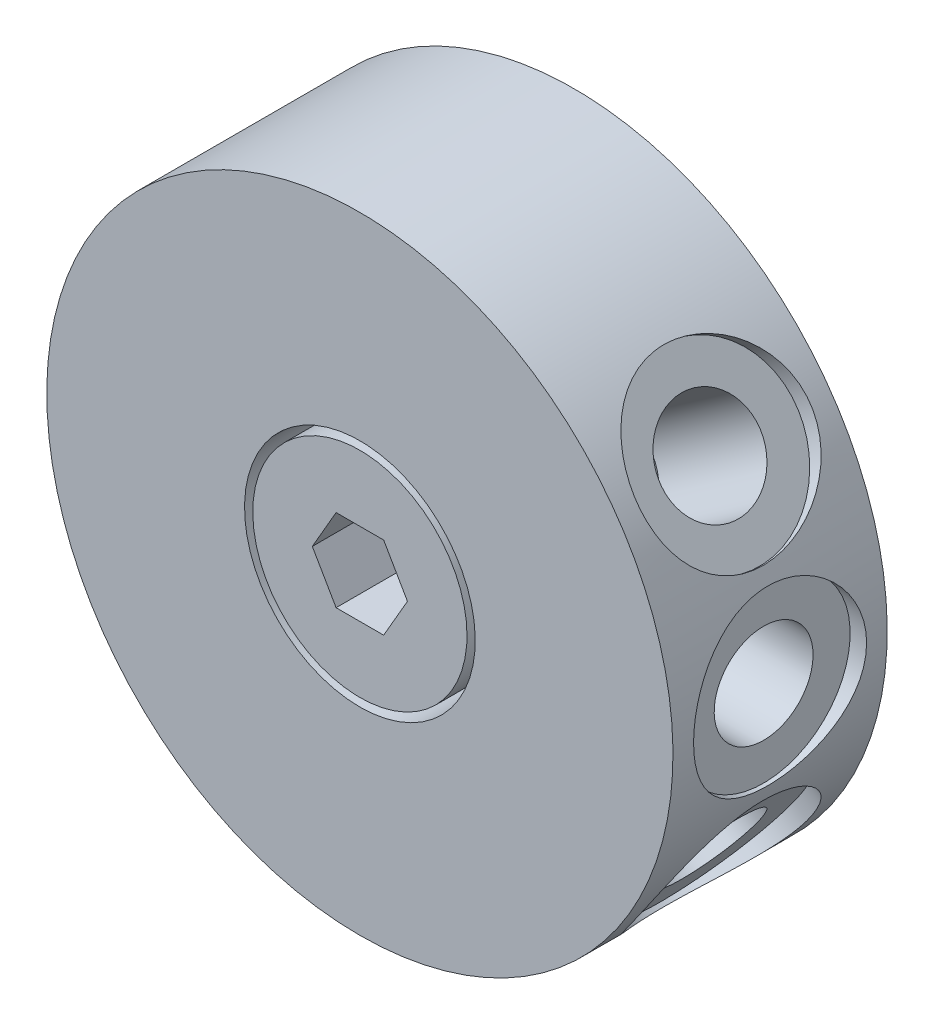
ISO-10303-21;
HEADER;
FILE_DESCRIPTION(('STEP AP214'),'2;1');
FILE_NAME('part.step','',(''),(''),'','','');
FILE_SCHEMA(('AUTOMOTIVE_DESIGN { 1 0 10303 214 1 1 1 1 }'));
ENDSEC;
DATA;
#1=APPLICATION_CONTEXT('core data for automotive mechanical design processes');
#2=APPLICATION_PROTOCOL_DEFINITION('international standard','automotive_design',2000,#1);
#3=PRODUCT_CONTEXT('',#1,'mechanical');
#4=PRODUCT('Part','Part','',(#3));
#5=PRODUCT_RELATED_PRODUCT_CATEGORY('part','',(#4));
#6=PRODUCT_DEFINITION_FORMATION('','',#4);
#7=PRODUCT_DEFINITION_CONTEXT('part definition',#1,'design');
#8=PRODUCT_DEFINITION('design','',#6,#7);
#9=PRODUCT_DEFINITION_SHAPE('','',#8);
#10=(LENGTH_UNIT() NAMED_UNIT(*) SI_UNIT(.MILLI.,.METRE.));
#11=(NAMED_UNIT(*) PLANE_ANGLE_UNIT() SI_UNIT($,.RADIAN.));
#12=(NAMED_UNIT(*) SI_UNIT($,.STERADIAN.) SOLID_ANGLE_UNIT());
#13=UNCERTAINTY_MEASURE_WITH_UNIT(LENGTH_MEASURE(1.E-05),#10,'distance_accuracy_value','');
#14=(GEOMETRIC_REPRESENTATION_CONTEXT(3) GLOBAL_UNCERTAINTY_ASSIGNED_CONTEXT((#13)) GLOBAL_UNIT_ASSIGNED_CONTEXT((#10,
#11,#12)) REPRESENTATION_CONTEXT('',''));
#15=CARTESIAN_POINT('',(0.,0.,0.));
#16=DIRECTION('',(0.,0.,1.));
#17=DIRECTION('',(1.,0.,0.));
#18=AXIS2_PLACEMENT_3D('',#15,#16,#17);
#19=CARTESIAN_POINT('',(0.,0.,13.));
#20=DIRECTION('',(0.,0.,-1.));
#21=DIRECTION('',(-0.996830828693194,0.0795506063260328,0.));
#22=AXIS2_PLACEMENT_3D('',#19,#20,#21);
#23=CYLINDRICAL_SURFACE('',#22,6.5);
#24=CARTESIAN_POINT('',(0.,0.,8.));
#25=DIRECTION('',(0.,0.,1.));
#26=DIRECTION('',(1.,0.,0.));
#27=AXIS2_PLACEMENT_3D('',#24,#25,#26);
#28=CIRCLE('',#27,6.5);
#29=CARTESIAN_POINT('',(6.5,0.,8.));
#30=VERTEX_POINT('',#29);
#31=EDGE_CURVE('E21',#30,#30,#28,.F.);
#32=ORIENTED_EDGE('',*,*,#31,.F.);
#33=EDGE_LOOP('',(#32));
#34=FACE_BOUND('',#33,.T.);
#35=CARTESIAN_POINT('',(0.,0.,13.));
#36=DIRECTION('',(0.,0.,1.));
#37=DIRECTION('',(0.996830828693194,-0.0795506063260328,0.));
#38=AXIS2_PLACEMENT_3D('',#35,#36,#37);
#39=CIRCLE('',#38,6.5);
#40=CARTESIAN_POINT('',(6.47940038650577,-0.517078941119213,13.));
#41=VERTEX_POINT('',#40);
#42=EDGE_CURVE('E125',#41,#41,#39,.T.);
#43=ORIENTED_EDGE('',*,*,#42,.F.);
#44=EDGE_LOOP('',(#43));
#45=FACE_BOUND('',#44,.T.);
#46=ADVANCED_FACE('F14',(#34,#45),#23,.T.);
#47=CARTESIAN_POINT('',(10.,0.,9.));
#48=DIRECTION('',(-1.,0.,0.));
#49=DIRECTION('',(0.,-1.,0.));
#50=AXIS2_PLACEMENT_3D('',#47,#48,#49);
#51=PLANE('',#50);
#52=CARTESIAN_POINT('',(10.,0.,6.5));
#53=DIRECTION('',(1.,0.,0.));
#54=DIRECTION('',(0.,1.,0.));
#55=AXIS2_PLACEMENT_3D('',#52,#53,#54);
#56=CIRCLE('',#55,3.);
#57=CARTESIAN_POINT('',(10.,2.99999999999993,6.5));
#58=VERTEX_POINT('',#57);
#59=EDGE_CURVE('E146',#58,#58,#56,.T.);
#60=ORIENTED_EDGE('',*,*,#59,.T.);
#61=EDGE_LOOP('',(#60));
#62=FACE_BOUND('',#61,.T.);
#63=ADVANCED_FACE('F207',(#62),#51,.F.);
#64=CARTESIAN_POINT('',(8.19152044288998,-5.73576436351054,9.));
#65=DIRECTION('',(-0.819152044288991,0.573576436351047,0.));
#66=DIRECTION('',(-0.573576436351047,-0.819152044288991,0.));
#67=AXIS2_PLACEMENT_3D('',#64,#65,#66);
#68=PLANE('',#67);
#69=CARTESIAN_POINT('',(8.19152044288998,-5.73576436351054,6.5));
#70=DIRECTION('',(0.819152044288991,-0.573576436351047,0.));
#71=DIRECTION('',(0.573576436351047,0.819152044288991,0.));
#72=AXIS2_PLACEMENT_3D('',#69,#70,#71);
#73=CIRCLE('',#72,3.);
#74=CARTESIAN_POINT('',(9.91224975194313,-3.27830823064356,6.5));
#75=VERTEX_POINT('',#74);
#76=EDGE_CURVE('E137',#75,#75,#73,.T.);
#77=ORIENTED_EDGE('',*,*,#76,.T.);
#78=EDGE_LOOP('',(#77));
#79=FACE_BOUND('',#78,.T.);
#80=ADVANCED_FACE('F213',(#79),#68,.F.);
#81=CARTESIAN_POINT('',(8.19152044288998,5.7357643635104,9.));
#82=DIRECTION('',(-0.819152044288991,-0.573576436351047,0.));
#83=DIRECTION('',(0.573576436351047,-0.819152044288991,0.));
#84=AXIS2_PLACEMENT_3D('',#81,#82,#83);
#85=PLANE('',#84);
#86=CARTESIAN_POINT('',(8.19152044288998,5.7357643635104,6.5));
#87=DIRECTION('',(0.819152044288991,0.573576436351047,0.));
#88=DIRECTION('',(-0.573576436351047,0.819152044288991,0.));
#89=AXIS2_PLACEMENT_3D('',#86,#87,#88);
#90=CIRCLE('',#89,3.);
#91=CARTESIAN_POINT('',(6.47079113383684,8.19322049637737,6.5));
#92=VERTEX_POINT('',#91);
#93=EDGE_CURVE('E128',#92,#92,#90,.T.);
#94=ORIENTED_EDGE('',*,*,#93,.T.);
#95=EDGE_LOOP('',(#94));
#96=FACE_BOUND('',#95,.T.);
#97=ADVANCED_FACE('F240',(#96),#85,.F.);
#98=CARTESIAN_POINT('',(18.,0.,6.5));
#99=DIRECTION('',(1.,0.,0.));
#100=DIRECTION('',(0.,1.,0.));
#101=AXIS2_PLACEMENT_3D('',#98,#99,#100);
#102=CYLINDRICAL_SURFACE('',#101,3.);
#103=ORIENTED_EDGE('',*,*,#59,.F.);
#104=EDGE_LOOP('',(#103));
#105=FACE_BOUND('',#104,.T.);
#106=CARTESIAN_POINT('',(18.,0.,6.5));
#107=DIRECTION('',(1.,0.,0.));
#108=DIRECTION('',(0.,1.,0.));
#109=AXIS2_PLACEMENT_3D('',#106,#107,#108);
#110=CIRCLE('',#109,3.);
#111=CARTESIAN_POINT('',(18.,2.99999999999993,6.5));
#112=VERTEX_POINT('',#111);
#113=EDGE_CURVE('E149',#112,#112,#110,.T.);
#114=ORIENTED_EDGE('',*,*,#113,.T.);
#115=EDGE_LOOP('',(#114));
#116=FACE_BOUND('',#115,.T.);
#117=ADVANCED_FACE('F246',(#105,#116),#102,.F.);
#118=CARTESIAN_POINT('',(14.7447367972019,-10.3243758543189,6.5));
#119=DIRECTION('',(0.819152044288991,-0.573576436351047,0.));
#120=DIRECTION('',(0.573576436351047,0.819152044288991,0.));
#121=AXIS2_PLACEMENT_3D('',#118,#119,#120);
#122=CYLINDRICAL_SURFACE('',#121,3.);
#123=CARTESIAN_POINT('',(14.7447367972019,-10.3243758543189,6.5));
#124=DIRECTION('',(0.819152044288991,-0.573576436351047,0.));
#125=DIRECTION('',(0.573576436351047,0.819152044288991,0.));
#126=AXIS2_PLACEMENT_3D('',#123,#124,#125);
#127=CIRCLE('',#126,3.);
#128=CARTESIAN_POINT('',(16.465466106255,-7.86691972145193,6.5));
#129=VERTEX_POINT('',#128);
#130=EDGE_CURVE('E140',#129,#129,#127,.T.);
#131=CARTESIAN_POINT('',(9.91224975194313,-3.27830823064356,6.5));
#132=CARTESIAN_POINT('',(9.98051242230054,-3.32610626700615,6.5));
#133=CARTESIAN_POINT('',(10.048775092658,-3.37390430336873,6.5));
#134=CARTESIAN_POINT('',(10.1853004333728,-3.46950037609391,6.5));
#135=CARTESIAN_POINT('',(10.2535631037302,-3.5172984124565,6.5));
#136=CARTESIAN_POINT('',(10.390088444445,-3.61289448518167,6.5));
#137=CARTESIAN_POINT('',(10.4583511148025,-3.66069252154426,6.5));
#138=CARTESIAN_POINT('',(10.5948764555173,-3.75628859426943,6.5));
#139=CARTESIAN_POINT('',(10.6631391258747,-3.80408663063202,6.5));
#140=CARTESIAN_POINT('',(10.7996644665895,-3.89968270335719,6.5));
#141=CARTESIAN_POINT('',(10.8679271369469,-3.94748073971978,6.5));
#142=CARTESIAN_POINT('',(11.0044524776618,-4.04307681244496,6.5));
#143=CARTESIAN_POINT('',(11.0727151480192,-4.09087484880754,6.5));
#144=CARTESIAN_POINT('',(11.209240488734,-4.18647092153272,6.5));
#145=CARTESIAN_POINT('',(11.2775031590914,-4.2342689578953,6.5));
#146=CARTESIAN_POINT('',(11.4140284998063,-4.32986503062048,6.5));
#147=CARTESIAN_POINT('',(11.4822911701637,-4.37766306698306,6.5));
#148=CARTESIAN_POINT('',(11.6188165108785,-4.47325913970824,6.5));
#149=CARTESIAN_POINT('',(11.6870791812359,-4.52105717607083,6.5));
#150=CARTESIAN_POINT('',(11.8236045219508,-4.616653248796,6.5));
#151=CARTESIAN_POINT('',(11.8918671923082,-4.66445128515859,6.5));
#152=CARTESIAN_POINT('',(12.028392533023,-4.76004735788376,6.5));
#153=CARTESIAN_POINT('',(12.0966552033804,-4.80784539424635,6.5));
#154=CARTESIAN_POINT('',(12.2331805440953,-4.90344146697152,6.5));
#155=CARTESIAN_POINT('',(12.3014432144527,-4.95123950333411,6.5));
#156=CARTESIAN_POINT('',(12.4379685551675,-5.04683557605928,6.5));
#157=CARTESIAN_POINT('',(12.5062312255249,-5.09463361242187,6.5));
#158=CARTESIAN_POINT('',(12.6427565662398,-5.19022968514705,6.5));
#159=CARTESIAN_POINT('',(12.7110192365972,-5.23802772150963,6.5));
#160=CARTESIAN_POINT('',(12.847544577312,-5.33362379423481,6.5));
#161=CARTESIAN_POINT('',(12.9158072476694,-5.38142183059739,6.5));
#162=CARTESIAN_POINT('',(13.0523325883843,-5.47701790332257,6.5));
#163=CARTESIAN_POINT('',(13.1205952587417,-5.52481593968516,6.5));
#164=CARTESIAN_POINT('',(13.2571205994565,-5.62041201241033,6.5));
#165=CARTESIAN_POINT('',(13.3253832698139,-5.66821004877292,6.5));
#166=CARTESIAN_POINT('',(13.4619086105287,-5.76380612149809,6.5));
#167=CARTESIAN_POINT('',(13.5301712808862,-5.81160415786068,6.5));
#168=CARTESIAN_POINT('',(13.666696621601,-5.90720023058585,6.5));
#169=CARTESIAN_POINT('',(13.7349592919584,-5.95499826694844,6.5));
#170=CARTESIAN_POINT('',(13.8714846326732,-6.05059433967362,6.5));
#171=CARTESIAN_POINT('',(13.9397473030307,-6.0983923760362,6.5));
#172=CARTESIAN_POINT('',(14.0762726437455,-6.19398844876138,6.5));
#173=CARTESIAN_POINT('',(14.1445353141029,-6.24178648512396,6.5));
#174=CARTESIAN_POINT('',(14.2810606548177,-6.33738255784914,6.5));
#175=CARTESIAN_POINT('',(14.3493233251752,-6.38518059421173,6.5));
#176=CARTESIAN_POINT('',(14.48584866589,-6.4807766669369,6.5));
#177=CARTESIAN_POINT('',(14.5541113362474,-6.52857470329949,6.5));
#178=CARTESIAN_POINT('',(14.6906366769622,-6.62417077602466,6.5));
#179=CARTESIAN_POINT('',(14.7588993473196,-6.67196881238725,6.5));
#180=CARTESIAN_POINT('',(14.8954246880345,-6.76756488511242,6.5));
#181=CARTESIAN_POINT('',(14.9636873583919,-6.81536292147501,6.5));
#182=CARTESIAN_POINT('',(15.1002126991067,-6.91095899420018,6.5));
#183=CARTESIAN_POINT('',(15.1684753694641,-6.95875703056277,6.5));
#184=CARTESIAN_POINT('',(15.305000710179,-7.05435310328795,6.5));
#185=CARTESIAN_POINT('',(15.3732633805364,-7.10215113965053,6.5));
#186=CARTESIAN_POINT('',(15.5097887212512,-7.19774721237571,6.5));
#187=CARTESIAN_POINT('',(15.5780513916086,-7.24554524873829,6.5));
#188=CARTESIAN_POINT('',(15.7145767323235,-7.34114132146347,6.5));
#189=CARTESIAN_POINT('',(15.7828394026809,-7.38893935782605,6.5));
#190=CARTESIAN_POINT('',(15.9193647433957,-7.48453543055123,6.5));
#191=CARTESIAN_POINT('',(15.9876274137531,-7.53233346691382,6.5));
#192=CARTESIAN_POINT('',(16.124152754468,-7.62792953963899,6.5));
#193=CARTESIAN_POINT('',(16.1924154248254,-7.67572757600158,6.5));
#194=CARTESIAN_POINT('',(16.3289407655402,-7.77132364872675,6.5));
#195=CARTESIAN_POINT('',(16.3972034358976,-7.81912168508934,6.5));
#196=CARTESIAN_POINT('',(16.465466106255,-7.86691972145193,6.5));
#197=B_SPLINE_CURVE_WITH_KNOTS('',3,(#131,#132,#133,#134,#135,#136,#137,#138,#139,#140,#141,
#142,#143,#144,#145,#146,#147,#148,#149,#150,#151,#152,#153,#154,#155,#156,#157,#158,#159,#160,
#161,#162,#163,#164,#165,#166,#167,#168,#169,#170,#171,#172,#173,#174,#175,#176,#177,#178,#179,
#180,#181,#182,#183,#184,#185,#186,#187,#188,#189,#190,#191,#192,#193,#194,#195,#196),
.UNSPECIFIED.,.F.,.F.,(4,2,2,2,2,2,2,2,2,2,2,2,2,2,2,2,2,2,2,2,2,2,2,2,2,2,2,2,2,2,2,2,4),(0.,
0.249999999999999,0.499999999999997,0.749999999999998,0.999999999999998,1.25,1.5,1.75,
1.99999999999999,2.25,2.49999999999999,2.74999999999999,2.99999999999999,3.24999999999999,
3.49999999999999,3.74999999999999,3.99999999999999,4.24999999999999,4.49999999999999,
4.74999999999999,4.99999999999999,5.24999999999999,5.49999999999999,5.74999999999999,
5.99999999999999,6.24999999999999,6.49999999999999,6.74999999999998,6.99999999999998,
7.24999999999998,7.49999999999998,7.74999999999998,7.99999999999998),.UNSPECIFIED.);
#198=EDGE_CURVE('BSEAM242',#75,#129,#197,.T.);
#199=ORIENTED_EDGE('',*,*,#76,.F.);
#200=ORIENTED_EDGE('',*,*,#130,.T.);
#201=ORIENTED_EDGE('',*,*,#198,.T.);
#202=ORIENTED_EDGE('',*,*,#198,.F.);
#203=EDGE_LOOP('',(#199,#201,#200,#202));
#204=FACE_BOUND('',#203,.T.);
#205=ADVANCED_FACE('F242',(#204),#122,.F.);
#206=CARTESIAN_POINT('',(14.7447367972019,10.3243758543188,6.5));
#207=DIRECTION('',(0.819152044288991,0.573576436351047,0.));
#208=DIRECTION('',(-0.573576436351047,0.819152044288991,0.));
#209=AXIS2_PLACEMENT_3D('',#206,#207,#208);
#210=CYLINDRICAL_SURFACE('',#209,3.);
#211=CARTESIAN_POINT('',(14.7447367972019,10.3243758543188,6.5));
#212=DIRECTION('',(0.819152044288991,0.573576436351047,0.));
#213=DIRECTION('',(-0.573576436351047,0.819152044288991,0.));
#214=AXIS2_PLACEMENT_3D('',#211,#212,#213);
#215=CIRCLE('',#214,3.);
#216=CARTESIAN_POINT('',(13.0240074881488,12.7818319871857,6.5));
#217=VERTEX_POINT('',#216);
#218=EDGE_CURVE('E131',#217,#217,#215,.T.);
#219=CARTESIAN_POINT('',(6.47079113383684,8.19322049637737,6.5));
#220=CARTESIAN_POINT('',(6.53905380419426,8.24101853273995,6.5));
#221=CARTESIAN_POINT('',(6.60731647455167,8.28881656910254,6.5));
#222=CARTESIAN_POINT('',(6.74384181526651,8.38441264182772,6.5));
#223=CARTESIAN_POINT('',(6.81210448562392,8.4322106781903,6.5));
#224=CARTESIAN_POINT('',(6.94862982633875,8.52780675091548,6.5));
#225=CARTESIAN_POINT('',(7.01689249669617,8.57560478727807,6.5));
#226=CARTESIAN_POINT('',(7.153417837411,8.67120086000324,6.5));
#227=CARTESIAN_POINT('',(7.22168050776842,8.71899889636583,6.5));
#228=CARTESIAN_POINT('',(7.35820584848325,8.814594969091,6.5));
#229=CARTESIAN_POINT('',(7.42646851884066,8.86239300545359,6.5));
#230=CARTESIAN_POINT('',(7.5629938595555,8.95798907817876,6.5));
#231=CARTESIAN_POINT('',(7.63125652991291,9.00578711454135,6.5));
#232=CARTESIAN_POINT('',(7.76778187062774,9.10138318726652,6.5));
#233=CARTESIAN_POINT('',(7.83604454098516,9.14918122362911,6.5));
#234=CARTESIAN_POINT('',(7.97256988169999,9.24477729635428,6.5));
#235=CARTESIAN_POINT('',(8.04083255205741,9.29257533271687,6.5));
#236=CARTESIAN_POINT('',(8.17735789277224,9.38817140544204,6.5));
#237=CARTESIAN_POINT('',(8.24562056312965,9.43596944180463,6.5));
#238=CARTESIAN_POINT('',(8.38214590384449,9.5315655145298,6.5));
#239=CARTESIAN_POINT('',(8.4504085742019,9.57936355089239,6.5));
#240=CARTESIAN_POINT('',(8.58693391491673,9.67495962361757,6.5));
#241=CARTESIAN_POINT('',(8.65519658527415,9.72275765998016,6.5));
#242=CARTESIAN_POINT('',(8.79172192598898,9.81835373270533,6.5));
#243=CARTESIAN_POINT('',(8.8599845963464,9.86615176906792,6.5));
#244=CARTESIAN_POINT('',(8.99650993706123,9.96174784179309,6.5));
#245=CARTESIAN_POINT('',(9.06477260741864,10.0095458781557,6.5));
#246=CARTESIAN_POINT('',(9.20129794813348,10.1051419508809,6.5));
#247=CARTESIAN_POINT('',(9.26956061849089,10.1529399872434,6.5));
#248=CARTESIAN_POINT('',(9.40608595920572,10.2485360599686,6.5));
#249=CARTESIAN_POINT('',(9.47434862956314,10.2963340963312,6.5));
#250=CARTESIAN_POINT('',(9.61087397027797,10.3919301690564,6.5));
#251=CARTESIAN_POINT('',(9.67913664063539,10.439728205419,6.5));
#252=CARTESIAN_POINT('',(9.81566198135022,10.5353242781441,6.5));
#253=CARTESIAN_POINT('',(9.88392465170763,10.5831223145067,6.5));
#254=CARTESIAN_POINT('',(10.0204499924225,10.6787183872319,6.5));
#255=CARTESIAN_POINT('',(10.0887126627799,10.7265164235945,6.5));
#256=CARTESIAN_POINT('',(10.2252380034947,10.8221124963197,6.5));
#257=CARTESIAN_POINT('',(10.2935006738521,10.8699105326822,6.5));
#258=CARTESIAN_POINT('',(10.430026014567,10.9655066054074,6.5));
#259=CARTESIAN_POINT('',(10.4982886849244,11.01330464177,6.5));
#260=CARTESIAN_POINT('',(10.6348140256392,11.1089007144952,6.5));
#261=CARTESIAN_POINT('',(10.7030766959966,11.1566987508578,6.5));
#262=CARTESIAN_POINT('',(10.8396020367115,11.2522948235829,6.5));
#263=CARTESIAN_POINT('',(10.9078647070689,11.3000928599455,6.5));
#264=CARTESIAN_POINT('',(11.0443900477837,11.3956889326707,6.5));
#265=CARTESIAN_POINT('',(11.1126527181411,11.4434869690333,6.5));
#266=CARTESIAN_POINT('',(11.249178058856,11.5390830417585,6.5));
#267=CARTESIAN_POINT('',(11.3174407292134,11.5868810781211,6.5));
#268=CARTESIAN_POINT('',(11.4539660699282,11.6824771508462,6.5));
#269=CARTESIAN_POINT('',(11.5222287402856,11.7302751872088,6.5));
#270=CARTESIAN_POINT('',(11.6587540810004,11.825871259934,6.5));
#271=CARTESIAN_POINT('',(11.7270167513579,11.8736692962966,6.5));
#272=CARTESIAN_POINT('',(11.8635420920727,11.9692653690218,6.5));
#273=CARTESIAN_POINT('',(11.9318047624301,12.0170634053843,6.5));
#274=CARTESIAN_POINT('',(12.0683301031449,12.1126594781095,6.5));
#275=CARTESIAN_POINT('',(12.1365927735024,12.1604575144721,6.5));
#276=CARTESIAN_POINT('',(12.2731181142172,12.2560535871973,6.5));
#277=CARTESIAN_POINT('',(12.3413807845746,12.3038516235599,6.5));
#278=CARTESIAN_POINT('',(12.4779061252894,12.399447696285,6.5));
#279=CARTESIAN_POINT('',(12.5461687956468,12.4472457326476,6.5));
#280=CARTESIAN_POINT('',(12.6826941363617,12.5428418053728,6.5));
#281=CARTESIAN_POINT('',(12.7509568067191,12.5906398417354,6.5));
#282=CARTESIAN_POINT('',(12.8874821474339,12.6862359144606,6.5));
#283=CARTESIAN_POINT('',(12.9557448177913,12.7340339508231,6.5));
#284=CARTESIAN_POINT('',(13.0240074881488,12.7818319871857,6.5));
#285=B_SPLINE_CURVE_WITH_KNOTS('',3,(#219,#220,#221,#222,#223,#224,#225,#226,#227,#228,#229,
#230,#231,#232,#233,#234,#235,#236,#237,#238,#239,#240,#241,#242,#243,#244,#245,#246,#247,#248,
#249,#250,#251,#252,#253,#254,#255,#256,#257,#258,#259,#260,#261,#262,#263,#264,#265,#266,#267,
#268,#269,#270,#271,#272,#273,#274,#275,#276,#277,#278,#279,#280,#281,#282,#283,#284),
.UNSPECIFIED.,.F.,.F.,(4,2,2,2,2,2,2,2,2,2,2,2,2,2,2,2,2,2,2,2,2,2,2,2,2,2,2,2,2,2,2,2,4),(0.,
0.249999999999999,0.5,0.75,0.999999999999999,1.25,1.5,1.75,2.,2.25,2.5,2.74999999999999,
2.99999999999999,3.25,3.49999999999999,3.74999999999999,3.99999999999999,4.24999999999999,
4.49999999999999,4.74999999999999,4.99999999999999,5.24999999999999,5.49999999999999,
5.74999999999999,5.99999999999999,6.24999999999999,6.49999999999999,6.74999999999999,
6.99999999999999,7.24999999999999,7.49999999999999,7.74999999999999,7.99999999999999),.UNSPECIFIED.);
#286=EDGE_CURVE('BSEAM245',#92,#217,#285,.T.);
#287=ORIENTED_EDGE('',*,*,#93,.F.);
#288=ORIENTED_EDGE('',*,*,#218,.T.);
#289=ORIENTED_EDGE('',*,*,#286,.T.);
#290=ORIENTED_EDGE('',*,*,#286,.F.);
#291=EDGE_LOOP('',(#287,#289,#288,#290));
#292=FACE_BOUND('',#291,.T.);
#293=ADVANCED_FACE('F245',(#292),#210,.F.);
#294=CARTESIAN_POINT('',(18.,0.,6.5));
#295=DIRECTION('',(1.,0.,0.));
#296=DIRECTION('',(0.,0.,1.));
#297=AXIS2_PLACEMENT_3D('',#294,#295,#296);
#298=PLANE('',#297);
#299=ORIENTED_EDGE('',*,*,#113,.F.);
#300=EDGE_LOOP('',(#299));
#301=FACE_BOUND('',#300,.T.);
#302=CARTESIAN_POINT('',(18.,0.,6.5));
#303=DIRECTION('',(1.,0.,0.));
#304=DIRECTION('',(0.,0.,1.));
#305=AXIS2_PLACEMENT_3D('',#302,#303,#304);
#306=CIRCLE('',#305,5.25);
#307=CARTESIAN_POINT('',(18.,0.,11.75));
#308=VERTEX_POINT('',#307);
#309=EDGE_CURVE('E152',#308,#308,#306,.T.);
#310=ORIENTED_EDGE('',*,*,#309,.T.);
#311=EDGE_LOOP('',(#310));
#312=FACE_BOUND('',#311,.T.);
#313=ADVANCED_FACE('F187',(#301,#312),#298,.T.);
#314=CARTESIAN_POINT('',(14.7447367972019,-10.3243758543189,6.5));
#315=DIRECTION('',(0.819152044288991,-0.573576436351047,0.));
#316=DIRECTION('',(0.,0.,1.));
#317=AXIS2_PLACEMENT_3D('',#314,#315,#316);
#318=PLANE('',#317);
#319=ORIENTED_EDGE('',*,*,#130,.F.);
#320=EDGE_LOOP('',(#319));
#321=FACE_BOUND('',#320,.T.);
#322=CARTESIAN_POINT('',(14.7447367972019,-10.3243758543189,6.5));
#323=DIRECTION('',(0.819152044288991,-0.573576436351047,0.));
#324=DIRECTION('',(0.,0.,1.));
#325=AXIS2_PLACEMENT_3D('',#322,#323,#324);
#326=CIRCLE('',#325,5.25);
#327=CARTESIAN_POINT('',(14.7447367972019,-10.3243758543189,11.75));
#328=VERTEX_POINT('',#327);
#329=EDGE_CURVE('E143',#328,#328,#326,.T.);
#330=ORIENTED_EDGE('',*,*,#329,.T.);
#331=EDGE_LOOP('',(#330));
#332=FACE_BOUND('',#331,.T.);
#333=ADVANCED_FACE('F248',(#321,#332),#318,.T.);
#334=CARTESIAN_POINT('',(14.7447367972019,10.3243758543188,6.5));
#335=DIRECTION('',(0.819152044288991,0.573576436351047,0.));
#336=DIRECTION('',(0.,0.,1.));
#337=AXIS2_PLACEMENT_3D('',#334,#335,#336);
#338=PLANE('',#337);
#339=ORIENTED_EDGE('',*,*,#218,.F.);
#340=EDGE_LOOP('',(#339));
#341=FACE_BOUND('',#340,.T.);
#342=CARTESIAN_POINT('',(14.7447367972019,10.3243758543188,6.5));
#343=DIRECTION('',(0.819152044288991,0.573576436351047,0.));
#344=DIRECTION('',(0.,0.,1.));
#345=AXIS2_PLACEMENT_3D('',#342,#343,#344);
#346=CIRCLE('',#345,5.25);
#347=CARTESIAN_POINT('',(14.7447367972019,10.3243758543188,11.75));
#348=VERTEX_POINT('',#347);
#349=EDGE_CURVE('E134',#348,#348,#346,.T.);
#350=ORIENTED_EDGE('',*,*,#349,.T.);
#351=EDGE_LOOP('',(#350));
#352=FACE_BOUND('',#351,.T.);
#353=ADVANCED_FACE('F185',(#341,#352),#338,.T.);
#354=CARTESIAN_POINT('',(18.,0.,6.5));
#355=DIRECTION('',(1.,0.,0.));
#356=DIRECTION('',(0.,0.,1.));
#357=AXIS2_PLACEMENT_3D('',#354,#355,#356);
#358=CYLINDRICAL_SURFACE('',#357,5.25);
#359=ORIENTED_EDGE('',*,*,#309,.F.);
#360=EDGE_LOOP('',(#359));
#361=FACE_BOUND('',#360,.T.);
#362=CARTESIAN_POINT('',(19.,0.,11.75));
#363=CARTESIAN_POINT('',(18.9999960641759,0.289025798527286,11.749993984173));
#364=CARTESIAN_POINT('',(18.9933406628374,0.578114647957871,11.7260527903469));
#365=CARTESIAN_POINT('',(18.9674382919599,1.14793901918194,11.6311060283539));
#366=CARTESIAN_POINT('',(18.9481859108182,1.4286708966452,11.5600802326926));
#367=CARTESIAN_POINT('',(18.8992102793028,1.9734757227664,11.3734689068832));
#368=CARTESIAN_POINT('',(18.8695010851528,2.23757047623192,11.2579431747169));
#369=CARTESIAN_POINT('',(18.802736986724,2.74263822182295,10.9858396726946));
#370=CARTESIAN_POINT('',(18.7656814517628,2.98360922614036,10.8292583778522));
#371=CARTESIAN_POINT('',(18.687186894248,3.44155081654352,10.4754004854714));
#372=CARTESIAN_POINT('',(18.6456686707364,3.65786793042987,10.2772957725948));
#373=CARTESIAN_POINT('',(18.5634263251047,4.05467053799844,9.8477832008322));
#374=CARTESIAN_POINT('',(18.5227023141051,4.23515104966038,9.61637071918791));
#375=CARTESIAN_POINT('',(18.4458416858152,4.55841291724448,9.12150880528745));
#376=CARTESIAN_POINT('',(18.4098045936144,4.70042982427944,8.8575431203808));
#377=CARTESIAN_POINT('',(18.3475680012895,4.9378044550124,8.30832293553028));
#378=CARTESIAN_POINT('',(18.3213665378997,5.03317149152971,8.02307269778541));
#379=CARTESIAN_POINT('',(18.2825876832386,5.17224549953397,7.44664725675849));
#380=CARTESIAN_POINT('',(18.2696969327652,5.21714299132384,7.15578089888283));
#381=CARTESIAN_POINT('',(18.2580638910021,5.25771687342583,6.57038081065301));
#382=CARTESIAN_POINT('',(18.2593187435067,5.25340320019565,6.27584783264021));
#383=CARTESIAN_POINT('',(18.2755554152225,5.19661953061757,5.7008727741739));
#384=CARTESIAN_POINT('',(18.2901226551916,5.1456038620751,5.42027347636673));
#385=CARTESIAN_POINT('',(18.3306770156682,4.99919931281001,4.87178107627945));
#386=CARTESIAN_POINT('',(18.3566651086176,4.90380665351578,4.60388905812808));
#387=CARTESIAN_POINT('',(18.4174879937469,4.67020315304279,4.08469028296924));
#388=CARTESIAN_POINT('',(18.4524250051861,4.53149321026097,3.83362056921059));
#389=CARTESIAN_POINT('',(18.5271558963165,4.21554036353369,3.35781646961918));
#390=CARTESIAN_POINT('',(18.5669507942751,4.0382893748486,3.13308762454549));
#391=CARTESIAN_POINT('',(18.6486270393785,3.64290902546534,2.70805141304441));
#392=CARTESIAN_POINT('',(18.6905325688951,3.42356223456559,2.50887948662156));
#393=CARTESIAN_POINT('',(18.7704587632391,2.95406494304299,2.14990527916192));
#394=CARTESIAN_POINT('',(18.8084792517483,2.70391304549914,1.99010478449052));
#395=CARTESIAN_POINT('',(18.8766146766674,2.17806364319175,1.71385813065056));
#396=CARTESIAN_POINT('',(18.9066895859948,1.90224592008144,1.59763029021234));
#397=CARTESIAN_POINT('',(18.9552564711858,1.33396186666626,1.41352797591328));
#398=CARTESIAN_POINT('',(18.9737511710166,1.04149946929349,1.3456421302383));
#399=CARTESIAN_POINT('',(18.9966565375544,0.45790750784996,1.2619633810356));
#400=CARTESIAN_POINT('',(19.0014840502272,0.1670151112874,1.24462818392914));
#401=CARTESIAN_POINT('',(18.9977163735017,-0.413525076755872,1.25826588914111));
#402=CARTESIAN_POINT('',(18.9891226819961,-0.703173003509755,1.28923340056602));
#403=CARTESIAN_POINT('',(18.9597485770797,-1.26740948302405,1.39733687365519));
#404=CARTESIAN_POINT('',(18.9391983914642,-1.54217813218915,1.47360118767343));
#405=CARTESIAN_POINT('',(18.8882535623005,-2.07498632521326,1.66911108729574));
#406=CARTESIAN_POINT('',(18.8578578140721,-2.33302398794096,1.78836149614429));
#407=CARTESIAN_POINT('',(18.7896307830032,-2.83095037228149,2.06924258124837));
#408=CARTESIAN_POINT('',(18.7516589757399,-3.07035455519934,2.23169720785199));
#409=CARTESIAN_POINT('',(18.6726628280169,-3.51904128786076,2.59334943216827));
#410=CARTESIAN_POINT('',(18.6316378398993,-3.72831741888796,2.79255483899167));
#411=CARTESIAN_POINT('',(18.5496062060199,-4.11739039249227,3.22926885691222));
#412=CARTESIAN_POINT('',(18.5086381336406,-4.29609594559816,3.4677588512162));
#413=CARTESIAN_POINT('',(18.4327188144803,-4.61098813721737,3.97221838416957));
#414=CARTESIAN_POINT('',(18.3977673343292,-4.74717642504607,4.23818685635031));
#415=CARTESIAN_POINT('',(18.3382454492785,-4.97215298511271,4.78882447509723));
#416=CARTESIAN_POINT('',(18.3136171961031,-5.06120614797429,5.0733787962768));
#417=CARTESIAN_POINT('',(18.2775534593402,-5.18995134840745,5.65422818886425));
#418=CARTESIAN_POINT('',(18.2661142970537,-5.22965715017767,5.95051996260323));
#419=CARTESIAN_POINT('',(18.258047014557,-5.2577468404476,6.53521733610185));
#420=CARTESIAN_POINT('',(18.2609108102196,-5.24789121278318,6.82353256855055));
#421=CARTESIAN_POINT('',(18.2799282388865,-5.18125456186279,7.39421880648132));
#422=CARTESIAN_POINT('',(18.2960814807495,-5.12447491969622,7.67658998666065));
#423=CARTESIAN_POINT('',(18.3395441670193,-4.9666566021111,8.22497348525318));
#424=CARTESIAN_POINT('',(18.3667529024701,-4.86601688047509,8.49110916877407));
#425=CARTESIAN_POINT('',(18.4292569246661,-4.62364385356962,9.00292456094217));
#426=CARTESIAN_POINT('',(18.4645535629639,-4.4819036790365,9.24860084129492));
#427=CARTESIAN_POINT('',(18.5406411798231,-4.1561275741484,9.72086267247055));
#428=CARTESIAN_POINT('',(18.5815699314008,-3.97090277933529,9.94660600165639));
#429=CARTESIAN_POINT('',(18.6635705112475,-3.56564240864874,10.3643779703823));
#430=CARTESIAN_POINT('',(18.7046423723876,-3.3455982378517,10.5563982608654));
#431=CARTESIAN_POINT('',(18.7834557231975,-2.87071326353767,10.9057242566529));
#432=CARTESIAN_POINT('',(18.8210963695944,-2.61517673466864,11.0621089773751));
#433=CARTESIAN_POINT('',(18.8876761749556,-2.0804034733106,11.3294578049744));
#434=CARTESIAN_POINT('',(18.916620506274,-1.80118095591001,11.4404489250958));
#435=CARTESIAN_POINT('',(18.9591357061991,-1.26946355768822,11.6006205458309));
#436=CARTESIAN_POINT('',(18.9743441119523,-1.01909851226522,11.6565019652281));
#437=CARTESIAN_POINT('',(18.9947774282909,-0.512505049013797,11.7311922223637));
#438=CARTESIAN_POINT('',(19.0000034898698,-0.256277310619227,11.750005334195));
#439=CARTESIAN_POINT('',(19.,0.,11.75));
#440=B_SPLINE_CURVE_WITH_KNOTS('',3,(#362,#363,#364,#365,#366,#367,#368,#369,#370,#371,#372,
#373,#374,#375,#376,#377,#378,#379,#380,#381,#382,#383,#384,#385,#386,#387,#388,#389,#390,#391,
#392,#393,#394,#395,#396,#397,#398,#399,#400,#401,#402,#403,#404,#405,#406,#407,#408,#409,#410,
#411,#412,#413,#414,#415,#416,#417,#418,#419,#420,#421,#422,#423,#424,#425,#426,#427,#428,#429,
#430,#431,#432,#433,#434,#435,#436,#437,#438,#439),.UNSPECIFIED.,.T.,.F.,(4,2,2,2,2,2,2,2,2,2,2,
2,2,2,2,2,2,2,2,2,2,2,2,2,2,2,2,2,2,2,2,2,2,2,2,2,2,2,4),(0.,0.866137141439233,1.73264661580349,
2.59799573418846,3.46341917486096,4.34810245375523,5.23290863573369,6.13418825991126,
7.0352878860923,7.91465372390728,8.79384200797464,9.64655012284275,10.4993308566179,
11.3623243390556,12.2254990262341,13.1190007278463,14.0125429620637,14.910504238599,
15.8082542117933,16.6783116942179,17.5482720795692,18.4020107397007,19.2558452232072,
20.1273033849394,20.9989469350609,21.8971238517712,22.7952659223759,23.6883055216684,
24.5810959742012,25.4424022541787,26.3036831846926,27.1572882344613,28.0110360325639,
28.891605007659,29.7723916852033,30.6738597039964,31.5747904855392,32.3428772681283,
33.1108754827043),.UNSPECIFIED.);
#441=CARTESIAN_POINT('',(19.,0.,11.75));
#442=VERTEX_POINT('',#441);
#443=EDGE_CURVE('E161',#442,#442,#440,.T.);
#444=ORIENTED_EDGE('',*,*,#443,.F.);
#445=EDGE_LOOP('',(#444));
#446=FACE_BOUND('',#445,.T.);
#447=ADVANCED_FACE('F179',(#361,#446),#358,.F.);
#448=CARTESIAN_POINT('',(14.7447367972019,-10.3243758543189,6.5));
#449=DIRECTION('',(0.819152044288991,-0.573576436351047,0.));
#450=DIRECTION('',(0.573576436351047,0.819152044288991,0.));
#451=AXIS2_PLACEMENT_3D('',#448,#449,#450);
#452=CYLINDRICAL_SURFACE('',#451,5.25);
#453=ORIENTED_EDGE('',*,*,#329,.F.);
#454=EDGE_LOOP('',(#453));
#455=FACE_BOUND('',#454,.T.);
#456=CARTESIAN_POINT('',(17.9692146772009,-6.17311298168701,6.5));
#457=CARTESIAN_POINT('',(17.9692149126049,-6.17312062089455,6.2112118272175));
#458=CARTESIAN_POINT('',(17.9611740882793,-6.19667080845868,5.92236041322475));
#459=CARTESIAN_POINT('',(17.9288006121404,-6.2897104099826,5.35302827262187));
#460=CARTESIAN_POINT('',(17.9044605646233,-6.35922067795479,5.07255140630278));
#461=CARTESIAN_POINT('',(17.838953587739,-6.54071517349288,4.52828789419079));
#462=CARTESIAN_POINT('',(17.7978115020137,-6.65263667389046,4.26447726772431));
#463=CARTESIAN_POINT('',(17.697865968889,-6.91411978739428,3.75989214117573));
#464=CARTESIAN_POINT('',(17.6390607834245,-7.06368510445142,3.51911991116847));
#465=CARTESIAN_POINT('',(17.5012143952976,-7.39871702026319,3.06098176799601));
#466=CARTESIAN_POINT('',(17.4217165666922,-7.58496706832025,2.84432602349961));
#467=CARTESIAN_POINT('',(17.2424445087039,-7.98410281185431,2.44686196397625));
#468=CARTESIAN_POINT('',(17.1426680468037,-8.1969914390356,2.26605760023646));
#469=CARTESIAN_POINT('',(16.9207303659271,-8.64595674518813,1.94243337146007));
#470=CARTESIAN_POINT('',(16.7982118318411,-8.88237079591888,1.80032456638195));
#471=CARTESIAN_POINT('',(16.5328777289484,-9.3669708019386,1.5627712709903));
#472=CARTESIAN_POINT('',(16.3900658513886,-9.61515461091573,1.46731830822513));
#473=CARTESIAN_POINT('',(16.0902657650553,-10.108640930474,1.32809904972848));
#474=CARTESIAN_POINT('',(15.9337106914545,-10.3538650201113,1.2831235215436));
#475=CARTESIAN_POINT('',(15.607374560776,-10.8395287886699,1.24232603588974));
#476=CARTESIAN_POINT('',(15.437595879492,-11.0799693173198,1.24649526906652));
#477=CARTESIAN_POINT('',(15.0947346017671,-11.542516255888,1.30302846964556));
#478=CARTESIAN_POINT('',(14.9218657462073,-11.7649427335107,1.35408516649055));
#479=CARTESIAN_POINT('',(14.5742382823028,-12.1929337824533,1.50082552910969));
#480=CARTESIAN_POINT('',(14.3994795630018,-12.3984973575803,1.5965118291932));
#481=CARTESIAN_POINT('',(14.0524651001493,-12.7905251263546,1.830764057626));
#482=CARTESIAN_POINT('',(13.8802545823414,-12.9767673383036,1.96976753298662));
#483=CARTESIAN_POINT('',(13.5467227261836,-13.3245808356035,2.2863698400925));
#484=CARTESIAN_POINT('',(13.3854036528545,-13.4861469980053,2.46397666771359));
#485=CARTESIAN_POINT('',(13.0750767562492,-13.7873388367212,2.85964053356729));
#486=CARTESIAN_POINT('',(12.9266484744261,-13.9260679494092,3.07883599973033));
#487=CARTESIAN_POINT('',(12.6551209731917,-14.1732749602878,3.54787977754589));
#488=CARTESIAN_POINT('',(12.5320235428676,-14.2817507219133,3.79773025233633));
#489=CARTESIAN_POINT('',(12.3166860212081,-14.4678864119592,4.32344107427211));
#490=CARTESIAN_POINT('',(12.2246693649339,-14.54532392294,4.59947221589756));
#491=CARTESIAN_POINT('',(12.078060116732,-14.6672990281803,5.16822746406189));
#492=CARTESIAN_POINT('',(12.0234574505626,-14.71184547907,5.4609470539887));
#493=CARTESIAN_POINT('',(11.9561965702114,-14.7665566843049,6.0447428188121));
#494=CARTESIAN_POINT('',(11.9422534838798,-14.7777748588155,6.33557247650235));
#495=CARTESIAN_POINT('',(11.9535084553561,-14.7686726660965,6.91595430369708));
#496=CARTESIAN_POINT('',(11.9787019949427,-14.7483559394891,7.20550661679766));
#497=CARTESIAN_POINT('',(12.0657269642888,-14.6772356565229,7.76881145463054));
#498=CARTESIAN_POINT('',(12.1267770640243,-14.6270819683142,8.04276816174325));
#499=CARTESIAN_POINT('',(12.2814602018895,-14.4974429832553,8.57402380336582));
#500=CARTESIAN_POINT('',(12.3750977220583,-14.417953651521,8.83132044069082));
#501=CARTESIAN_POINT('',(12.5927202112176,-14.2283039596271,9.3285939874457));
#502=CARTESIAN_POINT('',(12.7173633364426,-14.1174701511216,9.56802552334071));
#503=CARTESIAN_POINT('',(12.9898585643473,-13.8671460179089,10.0168451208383));
#504=CARTESIAN_POINT('',(13.1377153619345,-13.7276498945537,10.2262270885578));
#505=CARTESIAN_POINT('',(13.4551430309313,-13.4167772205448,10.6157436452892));
#506=CARTESIAN_POINT('',(13.6252488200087,-13.2445392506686,10.7947572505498));
#507=CARTESIAN_POINT('',(13.9760538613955,-12.8738085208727,11.110192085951));
#508=CARTESIAN_POINT('',(14.1567525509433,-12.6753171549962,11.2466155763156));
#509=CARTESIAN_POINT('',(14.5200031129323,-12.2574662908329,11.4717159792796));
#510=CARTESIAN_POINT('',(14.7025299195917,-12.0382796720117,11.5607532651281));
#511=CARTESIAN_POINT('',(15.0638146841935,-11.5829973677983,11.6895721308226));
#512=CARTESIAN_POINT('',(15.242573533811,-11.3469057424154,11.7293654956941));
#513=CARTESIAN_POINT('',(15.584371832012,-10.8724446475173,11.7577837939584));
#514=CARTESIAN_POINT('',(15.7477348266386,-10.6344050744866,11.7480474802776));
#515=CARTESIAN_POINT('',(16.0605532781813,-10.1558043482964,11.681519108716));
#516=CARTESIAN_POINT('',(16.2100093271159,-9.9152433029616,11.6247290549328));
#517=CARTESIAN_POINT('',(16.4907058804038,-9.44097606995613,11.466658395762));
#518=CARTESIAN_POINT('',(16.6220806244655,-9.20723080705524,11.3657318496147));
#519=CARTESIAN_POINT('',(16.8662869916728,-8.75186812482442,11.1225681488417));
#520=CARTESIAN_POINT('',(16.9791158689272,-8.53025250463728,10.980324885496));
#521=CARTESIAN_POINT('',(17.1885716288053,-8.10011666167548,10.6538909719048));
#522=CARTESIAN_POINT('',(17.2846513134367,-7.89214261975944,10.4686296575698));
#523=CARTESIAN_POINT('',(17.4569083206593,-7.5034422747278,10.0634202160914));
#524=CARTESIAN_POINT('',(17.5330802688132,-7.32272333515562,9.84346274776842));
#525=CARTESIAN_POINT('',(17.6679180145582,-6.99124682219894,9.36873210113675));
#526=CARTESIAN_POINT('',(17.7261177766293,-6.8413160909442,9.11324773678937));
#527=CARTESIAN_POINT('',(17.8234763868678,-6.58352486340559,8.57861679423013));
#528=CARTESIAN_POINT('',(17.8626468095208,-6.47563880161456,8.2994847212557));
#529=CARTESIAN_POINT('',(17.918413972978,-6.3195116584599,7.76811934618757));
#530=CARTESIAN_POINT('',(17.9374954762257,-6.26480159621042,7.51802852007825));
#531=CARTESIAN_POINT('',(17.9628948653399,-6.19160130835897,7.01197449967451));
#532=CARTESIAN_POINT('',(17.9692144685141,-6.17310620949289,6.75601210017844));
#533=CARTESIAN_POINT('',(17.9692146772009,-6.17311298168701,6.5));
#534=B_SPLINE_CURVE_WITH_KNOTS('',3,(#456,#457,#458,#459,#460,#461,#462,#463,#464,#465,#466,
#467,#468,#469,#470,#471,#472,#473,#474,#475,#476,#477,#478,#479,#480,#481,#482,#483,#484,#485,
#486,#487,#488,#489,#490,#491,#492,#493,#494,#495,#496,#497,#498,#499,#500,#501,#502,#503,#504,
#505,#506,#507,#508,#509,#510,#511,#512,#513,#514,#515,#516,#517,#518,#519,#520,#521,#522,#523,
#524,#525,#526,#527,#528,#529,#530,#531,#532,#533),.UNSPECIFIED.,.T.,.F.,(4,2,2,2,2,2,2,2,2,2,2,
2,2,2,2,2,2,2,2,2,2,2,2,2,2,2,2,2,2,2,2,2,2,2,2,2,2,2,4),(0.,0.865422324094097,1.73123759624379,
2.5957772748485,3.46040205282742,4.34601803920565,5.23173157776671,6.13276426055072,
7.03363325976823,7.91242704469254,8.79106330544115,9.64592243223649,10.5008320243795,
11.3646734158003,12.2286939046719,13.1211364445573,14.0136419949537,14.9124334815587,
15.8109828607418,16.6808122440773,17.5505412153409,18.4019868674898,19.2535496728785,
20.1250160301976,20.9966588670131,21.8955925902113,22.7944785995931,23.6864271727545,
24.5781622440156,25.4405889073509,26.302978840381,27.1585741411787,28.0142960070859,
28.8941710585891,29.7742834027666,30.6756021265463,31.5763719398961,32.3436762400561,
33.1108772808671),.UNSPECIFIED.);
#535=CARTESIAN_POINT('',(17.9692146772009,-6.17311298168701,6.5));
#536=VERTEX_POINT('',#535);
#537=EDGE_CURVE('E169',#536,#536,#534,.T.);
#538=ORIENTED_EDGE('',*,*,#537,.F.);
#539=EDGE_LOOP('',(#538));
#540=FACE_BOUND('',#539,.T.);
#541=ADVANCED_FACE('F184',(#455,#540),#452,.F.);
#542=CARTESIAN_POINT('',(14.7447367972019,10.3243758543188,6.5));
#543=DIRECTION('',(0.819152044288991,0.573576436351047,0.));
#544=DIRECTION('',(-0.573576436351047,0.819152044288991,0.));
#545=AXIS2_PLACEMENT_3D('',#542,#543,#544);
#546=CYLINDRICAL_SURFACE('',#545,5.25);
#547=ORIENTED_EDGE('',*,*,#349,.F.);
#548=EDGE_LOOP('',(#547));
#549=FACE_BOUND('',#548,.T.);
#550=CARTESIAN_POINT('',(11.9466620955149,14.7742094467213,6.5));
#551=CARTESIAN_POINT('',(11.9466693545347,14.7742070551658,6.21121182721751));
#552=CARTESIAN_POINT('',(11.9660491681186,14.758596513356,5.92236041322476));
#553=CARTESIAN_POINT('',(12.0424054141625,14.696353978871,5.35302827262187));
#554=CARTESIAN_POINT('',(12.0993989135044,14.6497079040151,5.07255140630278));
#555=CARTESIAN_POINT('',(12.2475432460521,14.5260767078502,4.5282878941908));
#556=CARTESIAN_POINT('',(12.3386436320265,14.4491363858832,4.26447726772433));
#557=CARTESIAN_POINT('',(12.5501739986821,14.2657858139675,3.75989214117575));
#558=CARTESIAN_POINT('',(12.6706068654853,14.1593726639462,3.51911991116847));
#559=CARTESIAN_POINT('',(12.9382876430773,13.9152517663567,3.06098176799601));
#560=CARTESIAN_POINT('',(13.0861155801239,13.7768469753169,2.84432602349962));
#561=CARTESIAN_POINT('',(13.3998658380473,13.4718738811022,2.44686196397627));
#562=CARTESIAN_POINT('',(13.5657901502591,13.3053024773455,2.26605760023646));
#563=CARTESIAN_POINT('',(13.9117723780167,12.9431940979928,1.94243337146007));
#564=CARTESIAN_POINT('',(14.0920251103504,12.7472059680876,1.80032456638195));
#565=CARTESIAN_POINT('',(14.4566505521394,12.332130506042,1.56277127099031));
#566=CARTESIAN_POINT('',(14.6410225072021,12.113047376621,1.46731830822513));
#567=CARTESIAN_POINT('',(15.0022102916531,11.6625451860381,1.32809904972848));
#568=CARTESIAN_POINT('',(15.1791005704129,11.4315599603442,1.2831235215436));
#569=CARTESIAN_POINT('',(15.5238616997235,10.9587975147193,1.24232603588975));
#570=CARTESIAN_POINT('',(15.6917341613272,10.7170222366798,1.24649526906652));
#571=CARTESIAN_POINT('',(16.0091206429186,10.2366376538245,1.30302846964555));
#572=CARTESIAN_POINT('',(16.1590085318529,9.99811973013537,1.35408516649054));
#573=CARTESIAN_POINT('',(16.4422929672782,9.52507520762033,1.50082552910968));
#574=CARTESIAN_POINT('',(16.5756885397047,9.29054884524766,1.5965118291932));
#575=CARTESIAN_POINT('',(16.8253882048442,8.8303805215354,1.830764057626));
#576=CARTESIAN_POINT('',(16.9414991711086,8.60485698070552,1.9697675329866));
#577=CARTESIAN_POINT('',(17.1542623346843,8.17248033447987,2.28636984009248));
#578=CARTESIAN_POINT('',(17.2509104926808,7.96563110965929,2.46397666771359));
#579=CARTESIAN_POINT('',(17.4278001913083,7.5710055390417,2.85964053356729));
#580=CARTESIAN_POINT('',(17.5073974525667,7.38408042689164,3.07883599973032));
#581=CARTESIAN_POINT('',(17.6468281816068,7.04437826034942,3.54787977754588));
#582=CARTESIAN_POINT('',(17.706660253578,6.89160361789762,3.79773025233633));
#583=CARTESIAN_POINT('',(17.8079208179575,6.62559038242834,4.32344107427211));
#584=CARTESIAN_POINT('',(17.849216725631,6.51263782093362,4.59947221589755));
#585=CARTESIAN_POINT('',(17.9136925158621,6.3331522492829,5.16822746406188));
#586=CARTESIAN_POINT('',(17.936877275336,6.26660674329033,5.4609470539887));
#587=CARTESIAN_POINT('',(17.9652844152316,6.18468985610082,6.0447428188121));
#588=CARTESIAN_POINT('',(17.9710572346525,6.16775079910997,6.33557247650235));
#589=CARTESIAN_POINT('',(17.9663533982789,6.1814401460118,6.91595430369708));
#590=CARTESIAN_POINT('',(17.9558786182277,6.21206305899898,7.20550661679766));
#591=CARTESIAN_POINT('',(17.9188117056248,6.31816434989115,7.76881145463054));
#592=CARTESIAN_POINT('',(17.8925630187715,6.39268624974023,8.04276816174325));
#593=CARTESIAN_POINT('',(17.8236469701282,6.58237999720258,8.57402380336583));
#594=CARTESIAN_POINT('',(17.780977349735,6.69755743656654,8.83132044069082));
#595=CARTESIAN_POINT('',(17.6771962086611,6.96691969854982,9.32859398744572));
#596=CARTESIAN_POINT('',(17.615676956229,7.12195331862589,9.56802552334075));
#597=CARTESIAN_POINT('',(17.4736480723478,7.46363096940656,10.0168451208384));
#598=CARTESIAN_POINT('',(17.3931345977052,7.65028139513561,10.2262270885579));
#599=CARTESIAN_POINT('',(17.2095764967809,8.05489054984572,10.6157436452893));
#600=CARTESIAN_POINT('',(17.1059053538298,8.27364655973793,10.7947572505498));
#601=CARTESIAN_POINT('',(16.8775148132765,8.73009284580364,11.1101920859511));
#602=CARTESIAN_POINT('',(16.7527965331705,8.96778211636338,11.2466155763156));
#603=CARTESIAN_POINT('',(16.4843841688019,9.45203940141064,11.4717159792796));
#604=CARTESIAN_POINT('',(16.3408439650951,9.69852473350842,11.5607532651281));
#605=CARTESIAN_POINT('',(16.0365852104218,10.1937370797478,11.6895721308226));
#606=CARTESIAN_POINT('',(15.875870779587,10.4424635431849,11.7293654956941));
#607=CARTESIAN_POINT('',(15.5469250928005,10.9259241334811,11.7577837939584));
#608=CARTESIAN_POINT('',(15.3791144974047,11.1608494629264,11.7480474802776));
#609=CARTESIAN_POINT('',(15.0363671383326,11.618493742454,11.681519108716));
#610=CARTESIAN_POINT('',(14.8614306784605,11.8412132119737,11.6247290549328));
#611=CARTESIAN_POINT('',(14.5117691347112,12.2671906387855,11.466658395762));
#612=CARTESIAN_POINT('',(14.3370532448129,12.470588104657,11.3657318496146));
#613=CARTESIAN_POINT('',(13.9926757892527,12.8558102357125,11.1225681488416));
#614=CARTESIAN_POINT('',(13.8230149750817,13.0376317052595,10.980324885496));
#615=CARTESIAN_POINT('',(13.4904575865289,13.3815708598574,10.6538909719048));
#616=CARTESIAN_POINT('',(13.3278871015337,13.5429875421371,10.4686296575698));
#617=CARTESIAN_POINT('',(13.0215436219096,13.8377995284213,10.0634202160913));
#618=CARTESIAN_POINT('',(12.8777757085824,13.9711872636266,9.84346274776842));
#619=CARTESIAN_POINT('',(12.6124069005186,14.2112649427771,9.36873210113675));
#620=CARTESIAN_POINT('',(12.4914235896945,14.3172341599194,9.11324773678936));
#621=CARTESIAN_POINT('',(12.2824776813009,14.4968911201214,8.57861679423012));
#622=CARTESIAN_POINT('',(12.1944950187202,14.5705984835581,8.29948472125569));
#623=CARTESIAN_POINT('',(12.0668569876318,14.6764011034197,7.76811934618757));
#624=CARTESIAN_POINT('',(12.0219726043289,14.7130437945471,7.51802852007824));
#625=CARTESIAN_POINT('',(11.9618739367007,14.7619473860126,7.0119744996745));
#626=CARTESIAN_POINT('',(11.9466556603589,14.7742115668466,6.75601210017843));
#627=CARTESIAN_POINT('',(11.9466620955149,14.7742094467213,6.5));
#628=B_SPLINE_CURVE_WITH_KNOTS('',3,(#550,#551,#552,#553,#554,#555,#556,#557,#558,#559,#560,
#561,#562,#563,#564,#565,#566,#567,#568,#569,#570,#571,#572,#573,#574,#575,#576,#577,#578,#579,
#580,#581,#582,#583,#584,#585,#586,#587,#588,#589,#590,#591,#592,#593,#594,#595,#596,#597,#598,
#599,#600,#601,#602,#603,#604,#605,#606,#607,#608,#609,#610,#611,#612,#613,#614,#615,#616,#617,
#618,#619,#620,#621,#622,#623,#624,#625,#626,#627),.UNSPECIFIED.,.T.,.F.,(4,2,2,2,2,2,2,2,2,2,2,
2,2,2,2,2,2,2,2,2,2,2,2,2,2,2,2,2,2,2,2,2,2,2,2,2,2,2,4),(0.,0.865422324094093,1.73123759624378,
2.59577727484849,3.46040205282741,4.34601803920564,5.23173157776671,6.13276426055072,
7.03363325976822,7.91242704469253,8.79106330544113,9.64592243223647,10.5008320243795,
11.3646734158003,12.2286939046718,13.1211364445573,14.0136419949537,14.9124334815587,
15.8109828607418,16.6808122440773,17.5505412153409,18.4019868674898,19.2535496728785,
20.1250160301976,20.9966588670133,21.8955925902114,22.7944785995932,23.6864271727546,
24.5781622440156,25.4405889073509,26.302978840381,27.1585741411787,28.0142960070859,
28.8941710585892,29.7742834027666,30.6756021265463,31.5763719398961,32.3436762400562,
33.1108772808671),.UNSPECIFIED.);
#629=CARTESIAN_POINT('',(11.9466620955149,14.7742094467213,6.5));
#630=VERTEX_POINT('',#629);
#631=EDGE_CURVE('E225',#630,#630,#628,.T.);
#632=ORIENTED_EDGE('',*,*,#631,.F.);
#633=EDGE_LOOP('',(#632));
#634=FACE_BOUND('',#633,.T.);
#635=ADVANCED_FACE('F231',(#549,#634),#546,.F.);
#636=CARTESIAN_POINT('',(0.,0.,13.));
#637=DIRECTION('',(0.,0.,-1.));
#638=DIRECTION('',(0.,1.,0.));
#639=AXIS2_PLACEMENT_3D('',#636,#637,#638);
#640=CYLINDRICAL_SURFACE('',#639,19.);
#641=ORIENTED_EDGE('',*,*,#631,.T.);
#642=EDGE_LOOP('',(#641));
#643=FACE_BOUND('',#642,.T.);
#644=ORIENTED_EDGE('',*,*,#537,.T.);
#645=EDGE_LOOP('',(#644));
#646=FACE_BOUND('',#645,.T.);
#647=ORIENTED_EDGE('',*,*,#443,.T.);
#648=EDGE_LOOP('',(#647));
#649=FACE_BOUND('',#648,.T.);
#650=CARTESIAN_POINT('',(0.,0.,13.));
#651=DIRECTION('',(0.,0.,1.));
#652=DIRECTION('',(0.,-1.,0.));
#653=AXIS2_PLACEMENT_3D('',#650,#651,#652);
#654=CIRCLE('',#653,19.);
#655=CARTESIAN_POINT('',(0.,-19.0000000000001,13.));
#656=VERTEX_POINT('',#655);
#657=EDGE_CURVE('E158',#656,#656,#654,.T.);
#658=ORIENTED_EDGE('',*,*,#657,.F.);
#659=EDGE_LOOP('',(#658));
#660=FACE_BOUND('',#659,.T.);
#661=CARTESIAN_POINT('',(0.,0.,0.));
#662=DIRECTION('',(0.,0.,1.));
#663=DIRECTION('',(0.,-1.,0.));
#664=AXIS2_PLACEMENT_3D('',#661,#662,#663);
#665=CIRCLE('',#664,19.);
#666=CARTESIAN_POINT('',(0.,-19.0000000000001,0.));
#667=VERTEX_POINT('',#666);
#668=EDGE_CURVE('E155',#667,#667,#665,.T.);
#669=ORIENTED_EDGE('',*,*,#668,.T.);
#670=EDGE_LOOP('',(#669));
#671=FACE_BOUND('',#670,.T.);
#672=ADVANCED_FACE('F175',(#643,#646,#649,#660,#671),#640,.T.);
#673=CARTESIAN_POINT('',(0.,0.,0.));
#674=DIRECTION('',(0.,0.,1.));
#675=DIRECTION('',(0.,-1.,0.));
#676=AXIS2_PLACEMENT_3D('',#673,#674,#675);
#677=PLANE('',#676);
#678=ORIENTED_EDGE('',*,*,#668,.F.);
#679=EDGE_LOOP('',(#678));
#680=FACE_BOUND('',#679,.T.);
#681=CARTESIAN_POINT('',(0.,0.,0.));
#682=DIRECTION('',(0.,0.,1.));
#683=DIRECTION('',(1.,0.,0.));
#684=AXIS2_PLACEMENT_3D('',#681,#682,#683);
#685=CIRCLE('',#684,4.);
#686=CARTESIAN_POINT('',(4.,0.,0.));
#687=VERTEX_POINT('',#686);
#688=EDGE_CURVE('E9',#687,#687,#685,.T.);
#689=ORIENTED_EDGE('',*,*,#688,.T.);
#690=EDGE_LOOP('',(#689));
#691=FACE_BOUND('',#690,.T.);
#692=ADVANCED_FACE('F189',(#680,#691),#677,.F.);
#693=CARTESIAN_POINT('',(0.,0.,13.));
#694=DIRECTION('',(0.,0.,1.));
#695=DIRECTION('',(0.,-1.,0.));
#696=AXIS2_PLACEMENT_3D('',#693,#694,#695);
#697=PLANE('',#696);
#698=CARTESIAN_POINT('',(0.,0.,13.));
#699=DIRECTION('',(0.,0.,1.));
#700=DIRECTION('',(0.,-1.,0.));
#701=AXIS2_PLACEMENT_3D('',#698,#699,#700);
#702=CIRCLE('',#701,7.);
#703=CARTESIAN_POINT('',(0.,-7.00000000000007,13.));
#704=VERTEX_POINT('',#703);
#705=EDGE_CURVE('E121',#704,#704,#702,.T.);
#706=ORIENTED_EDGE('',*,*,#705,.F.);
#707=EDGE_LOOP('',(#706));
#708=FACE_BOUND('',#707,.T.);
#709=ORIENTED_EDGE('',*,*,#657,.T.);
#710=EDGE_LOOP('',(#709));
#711=FACE_BOUND('',#710,.T.);
#712=ADVANCED_FACE('F191',(#708,#711),#697,.T.);
#713=CARTESIAN_POINT('',(0.,0.,8.));
#714=DIRECTION('',(0.,0.,1.));
#715=DIRECTION('',(0.,-1.,0.));
#716=AXIS2_PLACEMENT_3D('',#713,#714,#715);
#717=CYLINDRICAL_SURFACE('',#716,7.);
#718=CARTESIAN_POINT('',(0.,0.,8.));
#719=DIRECTION('',(0.,0.,1.));
#720=DIRECTION('',(0.,-1.,0.));
#721=AXIS2_PLACEMENT_3D('',#718,#719,#720);
#722=CIRCLE('',#721,7.);
#723=CARTESIAN_POINT('',(0.,-7.00000000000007,8.));
#724=VERTEX_POINT('',#723);
#725=EDGE_CURVE('E124',#724,#724,#722,.T.);
#726=ORIENTED_EDGE('',*,*,#725,.F.);
#727=EDGE_LOOP('',(#726));
#728=FACE_BOUND('',#727,.T.);
#729=ORIENTED_EDGE('',*,*,#705,.T.);
#730=EDGE_LOOP('',(#729));
#731=FACE_BOUND('',#730,.T.);
#732=ADVANCED_FACE('F194',(#728,#731),#717,.F.);
#733=CARTESIAN_POINT('',(0.,0.,8.));
#734=DIRECTION('',(0.,0.,1.));
#735=DIRECTION('',(0.,-1.,0.));
#736=AXIS2_PLACEMENT_3D('',#733,#734,#735);
#737=PLANE('',#736);
#738=ORIENTED_EDGE('',*,*,#725,.T.);
#739=EDGE_LOOP('',(#738));
#740=FACE_BOUND('',#739,.T.);
#741=ORIENTED_EDGE('',*,*,#31,.T.);
#742=EDGE_LOOP('',(#741));
#743=FACE_BOUND('',#742,.T.);
#744=ADVANCED_FACE('F201',(#740,#743),#737,.T.);
#745=CARTESIAN_POINT('',(0.,0.,13.));
#746=DIRECTION('',(0.,0.,1.));
#747=DIRECTION('',(0.996830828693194,-0.0795506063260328,0.));
#748=AXIS2_PLACEMENT_3D('',#745,#746,#747);
#749=PLANE('',#748);
#750=DIRECTION('',(0.5,0.866025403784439,0.));
#751=VECTOR('',#750,1.);
#752=CARTESIAN_POINT('',(1.44337567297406,-2.5,13.));
#753=LINE('',#752,#751);
#754=CARTESIAN_POINT('',(1.44337567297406,-2.5,13.));
#755=VERTEX_POINT('',#754);
#756=CARTESIAN_POINT('',(2.88675134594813,0.,13.));
#757=VERTEX_POINT('',#756);
#758=EDGE_CURVE('E28',#755,#757,#753,.T.);
#759=ORIENTED_EDGE('',*,*,#758,.F.);
#760=DIRECTION('',(1.,0.,0.));
#761=VECTOR('',#760,1.);
#762=CARTESIAN_POINT('',(-1.44337567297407,-2.5,13.));
#763=LINE('',#762,#761);
#764=CARTESIAN_POINT('',(-1.44337567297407,-2.5,13.));
#765=VERTEX_POINT('',#764);
#766=EDGE_CURVE('E111',#765,#755,#763,.T.);
#767=ORIENTED_EDGE('',*,*,#766,.F.);
#768=DIRECTION('',(0.5,-0.866025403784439,0.));
#769=VECTOR('',#768,1.);
#770=CARTESIAN_POINT('',(-2.88675134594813,0.,13.));
#771=LINE('',#770,#769);
#772=CARTESIAN_POINT('',(-2.88675134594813,0.,13.));
#773=VERTEX_POINT('',#772);
#774=EDGE_CURVE('E109',#773,#765,#771,.T.);
#775=ORIENTED_EDGE('',*,*,#774,.F.);
#776=DIRECTION('',(-0.5,-0.866025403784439,0.));
#777=VECTOR('',#776,1.);
#778=CARTESIAN_POINT('',(-1.44337567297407,2.5,13.));
#779=LINE('',#778,#777);
#780=CARTESIAN_POINT('',(-1.44337567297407,2.5,13.));
#781=VERTEX_POINT('',#780);
#782=EDGE_CURVE('E76',#781,#773,#779,.T.);
#783=ORIENTED_EDGE('',*,*,#782,.F.);
#784=DIRECTION('',(-1.,0.,0.));
#785=VECTOR('',#784,1.);
#786=CARTESIAN_POINT('',(1.44337567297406,2.5,13.));
#787=LINE('',#786,#785);
#788=CARTESIAN_POINT('',(1.44337567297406,2.5,13.));
#789=VERTEX_POINT('',#788);
#790=EDGE_CURVE('E105',#789,#781,#787,.T.);
#791=ORIENTED_EDGE('',*,*,#790,.F.);
#792=DIRECTION('',(-0.5,0.866025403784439,0.));
#793=VECTOR('',#792,1.);
#794=CARTESIAN_POINT('',(2.88675134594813,0.,13.));
#795=LINE('',#794,#793);
#796=EDGE_CURVE('E102',#757,#789,#795,.T.);
#797=ORIENTED_EDGE('',*,*,#796,.F.);
#798=EDGE_LOOP('',(#759,#767,#775,#783,#791,#797));
#799=FACE_BOUND('',#798,.T.);
#800=ORIENTED_EDGE('',*,*,#42,.T.);
#801=EDGE_LOOP('',(#800));
#802=FACE_BOUND('',#801,.T.);
#803=ADVANCED_FACE('F294',(#799,#802),#749,.T.);
#804=CARTESIAN_POINT('',(0.,0.,-8.));
#805=DIRECTION('',(0.,0.,-1.));
#806=DIRECTION('',(-0.996830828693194,0.0795506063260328,0.));
#807=AXIS2_PLACEMENT_3D('',#804,#805,#806);
#808=PLANE('',#807);
#809=CARTESIAN_POINT('',(0.,0.,-8.));
#810=DIRECTION('',(0.,0.,-1.));
#811=DIRECTION('',(-0.996830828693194,0.0795506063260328,0.));
#812=AXIS2_PLACEMENT_3D('',#809,#810,#811);
#813=CIRCLE('',#812,4.);
#814=CARTESIAN_POINT('',(-3.98732331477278,0.318202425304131,-8.));
#815=VERTEX_POINT('',#814);
#816=EDGE_CURVE('E115',#815,#815,#813,.T.);
#817=ORIENTED_EDGE('',*,*,#816,.T.);
#818=EDGE_LOOP('',(#817));
#819=FACE_BOUND('',#818,.T.);
#820=ADVANCED_FACE('F284',(#819),#808,.T.);
#821=CARTESIAN_POINT('',(0.,0.,-8.));
#822=DIRECTION('',(0.,0.,1.));
#823=DIRECTION('',(0.996830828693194,-0.0795506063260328,0.));
#824=AXIS2_PLACEMENT_3D('',#821,#822,#823);
#825=CYLINDRICAL_SURFACE('',#824,4.);
#826=ORIENTED_EDGE('',*,*,#816,.F.);
#827=EDGE_LOOP('',(#826));
#828=FACE_BOUND('',#827,.T.);
#829=ORIENTED_EDGE('',*,*,#688,.F.);
#830=EDGE_LOOP('',(#829));
#831=FACE_BOUND('',#830,.T.);
#832=ADVANCED_FACE('F281',(#828,#831),#825,.T.);
#833=CARTESIAN_POINT('',(1.44337567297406,-2.5,9.2));
#834=DIRECTION('',(0.866025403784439,-0.5,0.));
#835=DIRECTION('',(0.5,0.866025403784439,0.));
#836=AXIS2_PLACEMENT_3D('',#833,#834,#835);
#837=PLANE('',#836);
#838=ORIENTED_EDGE('',*,*,#758,.T.);
#839=DIRECTION('',(0.,0.,1.));
#840=VECTOR('',#839,1.);
#841=CARTESIAN_POINT('',(2.88675134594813,0.,9.2));
#842=LINE('',#841,#840);
#843=CARTESIAN_POINT('',(2.88675134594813,0.,9.2));
#844=VERTEX_POINT('',#843);
#845=EDGE_CURVE('E58',#844,#757,#842,.T.);
#846=ORIENTED_EDGE('',*,*,#845,.F.);
#847=DIRECTION('',(0.5,0.866025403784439,0.));
#848=VECTOR('',#847,1.);
#849=CARTESIAN_POINT('',(1.44337567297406,-2.5,9.2));
#850=LINE('',#849,#848);
#851=CARTESIAN_POINT('',(1.44337567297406,-2.5,9.2));
#852=VERTEX_POINT('',#851);
#853=EDGE_CURVE('E113',#852,#844,#850,.T.);
#854=ORIENTED_EDGE('',*,*,#853,.F.);
#855=DIRECTION('',(0.,0.,1.));
#856=VECTOR('',#855,1.);
#857=CARTESIAN_POINT('',(1.44337567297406,-2.5,9.2));
#858=LINE('',#857,#856);
#859=EDGE_CURVE('E36',#852,#755,#858,.T.);
#860=ORIENTED_EDGE('',*,*,#859,.T.);
#861=EDGE_LOOP('',(#838,#846,#854,#860));
#862=FACE_BOUND('',#861,.T.);
#863=ADVANCED_FACE('F283',(#862),#837,.F.);
#864=CARTESIAN_POINT('',(-1.44337567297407,-2.5,9.2));
#865=DIRECTION('',(0.,-1.,0.));
#866=DIRECTION('',(0.,0.,-1.));
#867=AXIS2_PLACEMENT_3D('',#864,#865,#866);
#868=PLANE('',#867);
#869=ORIENTED_EDGE('',*,*,#766,.T.);
#870=ORIENTED_EDGE('',*,*,#859,.F.);
#871=DIRECTION('',(1.,0.,0.));
#872=VECTOR('',#871,1.);
#873=CARTESIAN_POINT('',(-1.44337567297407,-2.5,9.2));
#874=LINE('',#873,#872);
#875=CARTESIAN_POINT('',(-1.44337567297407,-2.5,9.2));
#876=VERTEX_POINT('',#875);
#877=EDGE_CURVE('E88',#876,#852,#874,.T.);
#878=ORIENTED_EDGE('',*,*,#877,.F.);
#879=DIRECTION('',(0.,0.,1.));
#880=VECTOR('',#879,1.);
#881=CARTESIAN_POINT('',(-1.44337567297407,-2.5,9.2));
#882=LINE('',#881,#880);
#883=EDGE_CURVE('E80',#876,#765,#882,.T.);
#884=ORIENTED_EDGE('',*,*,#883,.T.);
#885=EDGE_LOOP('',(#869,#870,#878,#884));
#886=FACE_BOUND('',#885,.T.);
#887=ADVANCED_FACE('F292',(#886),#868,.F.);
#888=CARTESIAN_POINT('',(-2.88675134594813,0.,9.2));
#889=DIRECTION('',(-0.866025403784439,-0.5,0.));
#890=DIRECTION('',(0.5,-0.866025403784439,0.));
#891=AXIS2_PLACEMENT_3D('',#888,#889,#890);
#892=PLANE('',#891);
#893=ORIENTED_EDGE('',*,*,#774,.T.);
#894=ORIENTED_EDGE('',*,*,#883,.F.);
#895=DIRECTION('',(0.5,-0.866025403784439,0.));
#896=VECTOR('',#895,1.);
#897=CARTESIAN_POINT('',(-2.88675134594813,0.,9.2));
#898=LINE('',#897,#896);
#899=CARTESIAN_POINT('',(-2.88675134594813,0.,9.2));
#900=VERTEX_POINT('',#899);
#901=EDGE_CURVE('E84',#900,#876,#898,.T.);
#902=ORIENTED_EDGE('',*,*,#901,.F.);
#903=DIRECTION('',(0.,0.,1.));
#904=VECTOR('',#903,1.);
#905=CARTESIAN_POINT('',(-2.88675134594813,0.,9.2));
#906=LINE('',#905,#904);
#907=EDGE_CURVE('E69',#900,#773,#906,.T.);
#908=ORIENTED_EDGE('',*,*,#907,.T.);
#909=EDGE_LOOP('',(#893,#894,#902,#908));
#910=FACE_BOUND('',#909,.T.);
#911=ADVANCED_FACE('F85',(#910),#892,.F.);
#912=CARTESIAN_POINT('',(-1.44337567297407,2.5,9.2));
#913=DIRECTION('',(-0.866025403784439,0.5,0.));
#914=DIRECTION('',(-0.5,-0.866025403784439,0.));
#915=AXIS2_PLACEMENT_3D('',#912,#913,#914);
#916=PLANE('',#915);
#917=ORIENTED_EDGE('',*,*,#782,.T.);
#918=ORIENTED_EDGE('',*,*,#907,.F.);
#919=DIRECTION('',(-0.5,-0.866025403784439,0.));
#920=VECTOR('',#919,1.);
#921=CARTESIAN_POINT('',(-1.44337567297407,2.5,9.2));
#922=LINE('',#921,#920);
#923=CARTESIAN_POINT('',(-1.44337567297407,2.5,9.2));
#924=VERTEX_POINT('',#923);
#925=EDGE_CURVE('E73',#924,#900,#922,.T.);
#926=ORIENTED_EDGE('',*,*,#925,.F.);
#927=DIRECTION('',(0.,0.,1.));
#928=VECTOR('',#927,1.);
#929=CARTESIAN_POINT('',(-1.44337567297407,2.5,9.2));
#930=LINE('',#929,#928);
#931=EDGE_CURVE('E81',#924,#781,#930,.T.);
#932=ORIENTED_EDGE('',*,*,#931,.T.);
#933=EDGE_LOOP('',(#917,#918,#926,#932));
#934=FACE_BOUND('',#933,.T.);
#935=ADVANCED_FACE('F71',(#934),#916,.F.);
#936=CARTESIAN_POINT('',(1.44337567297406,2.5,9.2));
#937=DIRECTION('',(0.,1.,0.));
#938=DIRECTION('',(-1.,0.,0.));
#939=AXIS2_PLACEMENT_3D('',#936,#937,#938);
#940=PLANE('',#939);
#941=ORIENTED_EDGE('',*,*,#790,.T.);
#942=ORIENTED_EDGE('',*,*,#931,.F.);
#943=DIRECTION('',(-1.,0.,0.));
#944=VECTOR('',#943,1.);
#945=CARTESIAN_POINT('',(1.44337567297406,2.5,9.2));
#946=LINE('',#945,#944);
#947=CARTESIAN_POINT('',(1.44337567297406,2.5,9.2));
#948=VERTEX_POINT('',#947);
#949=EDGE_CURVE('E94',#948,#924,#946,.T.);
#950=ORIENTED_EDGE('',*,*,#949,.F.);
#951=DIRECTION('',(0.,0.,1.));
#952=VECTOR('',#951,1.);
#953=CARTESIAN_POINT('',(1.44337567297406,2.5,9.2));
#954=LINE('',#953,#952);
#955=EDGE_CURVE('E118',#948,#789,#954,.T.);
#956=ORIENTED_EDGE('',*,*,#955,.T.);
#957=EDGE_LOOP('',(#941,#942,#950,#956));
#958=FACE_BOUND('',#957,.T.);
#959=ADVANCED_FACE('F322',(#958),#940,.F.);
#960=CARTESIAN_POINT('',(2.88675134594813,0.,9.2));
#961=DIRECTION('',(0.866025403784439,0.5,0.));
#962=DIRECTION('',(-0.5,0.866025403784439,0.));
#963=AXIS2_PLACEMENT_3D('',#960,#961,#962);
#964=PLANE('',#963);
#965=ORIENTED_EDGE('',*,*,#796,.T.);
#966=ORIENTED_EDGE('',*,*,#955,.F.);
#967=DIRECTION('',(-0.5,0.866025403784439,0.));
#968=VECTOR('',#967,1.);
#969=CARTESIAN_POINT('',(2.88675134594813,0.,9.2));
#970=LINE('',#969,#968);
#971=EDGE_CURVE('E96',#844,#948,#970,.T.);
#972=ORIENTED_EDGE('',*,*,#971,.F.);
#973=ORIENTED_EDGE('',*,*,#845,.T.);
#974=EDGE_LOOP('',(#965,#966,#972,#973));
#975=FACE_BOUND('',#974,.T.);
#976=ADVANCED_FACE('F309',(#975),#964,.F.);
#977=CARTESIAN_POINT('',(0.,0.,9.2));
#978=DIRECTION('',(0.,0.,1.));
#979=DIRECTION('',(1.,0.,0.));
#980=AXIS2_PLACEMENT_3D('',#977,#978,#979);
#981=PLANE('',#980);
#982=ORIENTED_EDGE('',*,*,#853,.T.);
#983=ORIENTED_EDGE('',*,*,#971,.T.);
#984=ORIENTED_EDGE('',*,*,#949,.T.);
#985=ORIENTED_EDGE('',*,*,#925,.T.);
#986=ORIENTED_EDGE('',*,*,#901,.T.);
#987=ORIENTED_EDGE('',*,*,#877,.T.);
#988=EDGE_LOOP('',(#982,#983,#984,#985,#986,#987));
#989=FACE_BOUND('',#988,.T.);
#990=ADVANCED_FACE('F91',(#989),#981,.T.);
#991=CLOSED_SHELL('',(#46,#63,#80,#97,#117,#205,#293,#313,#333,#353,#447,#541,#635,#672,#692,
#712,#732,#744,#803,#820,#832,#863,#887,#911,#935,#959,#976,#990));
#992=MANIFOLD_SOLID_BREP('B1',#991);
#993=ADVANCED_BREP_SHAPE_REPRESENTATION('',(#18,#992),#14);
#994=SHAPE_DEFINITION_REPRESENTATION(#9,#993);
ENDSEC;
END-ISO-10303-21;
